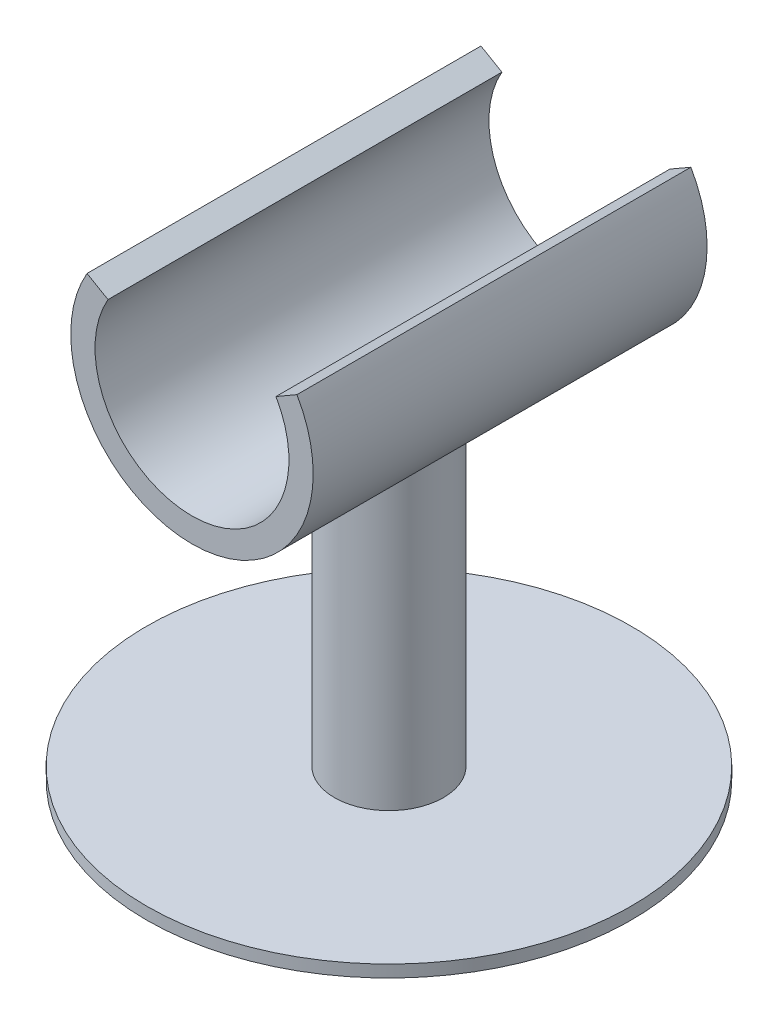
ISO-10303-21;
HEADER;
FILE_DESCRIPTION(('STEP AP214'),'2;1');
FILE_NAME('part.step','',(''),(''),'','','');
FILE_SCHEMA(('AUTOMOTIVE_DESIGN { 1 0 10303 214 1 1 1 1 }'));
ENDSEC;
DATA;
#1=APPLICATION_CONTEXT('core data for automotive mechanical design processes');
#2=APPLICATION_PROTOCOL_DEFINITION('international standard','automotive_design',2000,#1);
#3=PRODUCT_CONTEXT('',#1,'mechanical');
#4=PRODUCT('Part','Part','',(#3));
#5=PRODUCT_RELATED_PRODUCT_CATEGORY('part','',(#4));
#6=PRODUCT_DEFINITION_FORMATION('','',#4);
#7=PRODUCT_DEFINITION_CONTEXT('part definition',#1,'design');
#8=PRODUCT_DEFINITION('design','',#6,#7);
#9=PRODUCT_DEFINITION_SHAPE('','',#8);
#10=(LENGTH_UNIT() NAMED_UNIT(*) SI_UNIT(.MILLI.,.METRE.));
#11=(NAMED_UNIT(*) PLANE_ANGLE_UNIT() SI_UNIT($,.RADIAN.));
#12=(NAMED_UNIT(*) SI_UNIT($,.STERADIAN.) SOLID_ANGLE_UNIT());
#13=UNCERTAINTY_MEASURE_WITH_UNIT(LENGTH_MEASURE(1.E-05),#10,'distance_accuracy_value','');
#14=(GEOMETRIC_REPRESENTATION_CONTEXT(3) GLOBAL_UNCERTAINTY_ASSIGNED_CONTEXT((#13)) GLOBAL_UNIT_ASSIGNED_CONTEXT((#10,
#11,#12)) REPRESENTATION_CONTEXT('',''));
#15=CARTESIAN_POINT('',(0.,0.,0.));
#16=DIRECTION('',(0.,0.,1.));
#17=DIRECTION('',(1.,0.,0.));
#18=AXIS2_PLACEMENT_3D('',#15,#16,#17);
#19=CARTESIAN_POINT('',(0.,-68.,0.));
#20=DIRECTION('',(0.,1.,0.));
#21=DIRECTION('',(0.,0.,1.));
#22=AXIS2_PLACEMENT_3D('',#19,#20,#21);
#23=PLANE('',#22);
#24=CARTESIAN_POINT('',(0.,-68.,0.));
#25=DIRECTION('',(0.,1.,0.));
#26=DIRECTION('',(0.,0.,1.));
#27=AXIS2_PLACEMENT_3D('',#24,#25,#26);
#28=CIRCLE('',#27,40.);
#29=CARTESIAN_POINT('',(0.,-68.,40.));
#30=VERTEX_POINT('',#29);
#31=EDGE_CURVE('E11',#30,#30,#28,.T.);
#32=ORIENTED_EDGE('',*,*,#31,.T.);
#33=EDGE_LOOP('',(#32));
#34=FACE_BOUND('',#33,.T.);
#35=CARTESIAN_POINT('',(0.,-68.,0.));
#36=DIRECTION('',(0.,1.,0.));
#37=DIRECTION('',(0.,0.,1.));
#38=AXIS2_PLACEMENT_3D('',#35,#36,#37);
#39=CIRCLE('',#38,9.);
#40=CARTESIAN_POINT('',(0.,-68.,9.));
#41=VERTEX_POINT('',#40);
#42=EDGE_CURVE('E109',#41,#41,#39,.T.);
#43=ORIENTED_EDGE('',*,*,#42,.F.);
#44=EDGE_LOOP('',(#43));
#45=FACE_BOUND('',#44,.T.);
#46=ADVANCED_FACE('F32',(#34,#45),#23,.T.);
#47=CARTESIAN_POINT('',(0.,-68.,0.));
#48=DIRECTION('',(0.,-1.,0.));
#49=DIRECTION('',(0.,0.,-1.));
#50=AXIS2_PLACEMENT_3D('',#47,#48,#49);
#51=CYLINDRICAL_SURFACE('',#50,40.);
#52=ORIENTED_EDGE('',*,*,#31,.F.);
#53=EDGE_LOOP('',(#52));
#54=FACE_BOUND('',#53,.T.);
#55=CARTESIAN_POINT('',(0.,-70.,0.));
#56=DIRECTION('',(0.,1.,0.));
#57=DIRECTION('',(0.,0.,1.));
#58=AXIS2_PLACEMENT_3D('',#55,#56,#57);
#59=CIRCLE('',#58,40.);
#60=CARTESIAN_POINT('',(0.,-70.,40.));
#61=VERTEX_POINT('',#60);
#62=EDGE_CURVE('E36',#61,#61,#59,.T.);
#63=ORIENTED_EDGE('',*,*,#62,.T.);
#64=EDGE_LOOP('',(#63));
#65=FACE_BOUND('',#64,.T.);
#66=ADVANCED_FACE('F34',(#54,#65),#51,.T.);
#67=CARTESIAN_POINT('',(0.,-70.,0.));
#68=DIRECTION('',(0.,1.,0.));
#69=DIRECTION('',(0.,0.,1.));
#70=AXIS2_PLACEMENT_3D('',#67,#68,#69);
#71=PLANE('',#70);
#72=ORIENTED_EDGE('',*,*,#62,.F.);
#73=EDGE_LOOP('',(#72));
#74=FACE_BOUND('',#73,.T.);
#75=ADVANCED_FACE('F148',(#74),#71,.F.);
#76=CARTESIAN_POINT('',(0.,10.0010000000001,0.));
#77=DIRECTION('',(0.,-1.,0.));
#78=DIRECTION('',(0.,0.,-1.));
#79=AXIS2_PLACEMENT_3D('',#76,#77,#78);
#80=CYLINDRICAL_SURFACE('',#79,9.);
#81=ORIENTED_EDGE('',*,*,#42,.T.);
#82=EDGE_LOOP('',(#81));
#83=FACE_BOUND('',#82,.T.);
#84=CARTESIAN_POINT('',(0.,-20.,-9.));
#85=CARTESIAN_POINT('',(-0.239429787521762,-19.9999985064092,-8.99999822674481));
#86=CARTESIAN_POINT('',(-0.478916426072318,-19.9956892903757,-8.99043321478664));
#87=CARTESIAN_POINT('',(-0.956162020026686,-19.9785592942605,-8.95226864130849));
#88=CARTESIAN_POINT('',(-1.19391993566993,-19.965733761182,-8.92365845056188));
#89=CARTESIAN_POINT('',(-1.66631126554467,-19.9318736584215,-8.84764081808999));
#90=CARTESIAN_POINT('',(-1.90093746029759,-19.9108226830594,-8.80019580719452));
#91=CARTESIAN_POINT('',(-2.36491141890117,-19.8610585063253,-8.68701475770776));
#92=CARTESIAN_POINT('',(-2.5942588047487,-19.8323447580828,-8.62127741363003));
#93=CARTESIAN_POINT('',(-3.04529734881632,-19.7681022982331,-8.47244678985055));
#94=CARTESIAN_POINT('',(-3.26701374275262,-19.7325992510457,-8.38941876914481));
#95=CARTESIAN_POINT('',(-3.70234023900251,-19.6555728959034,-8.20660801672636));
#96=CARTESIAN_POINT('',(-3.91595009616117,-19.6140494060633,-8.10682477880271));
#97=CARTESIAN_POINT('',(-4.33377259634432,-19.5259822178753,-7.89136497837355));
#98=CARTESIAN_POINT('',(-4.53798969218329,-19.4794409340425,-7.77569605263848));
#99=CARTESIAN_POINT('',(-4.93616834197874,-19.3823697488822,-7.52921588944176));
#100=CARTESIAN_POINT('',(-5.13012612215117,-19.3318383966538,-7.39839913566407));
#101=CARTESIAN_POINT('',(-5.51651224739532,-19.2252516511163,-7.11536110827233));
#102=CARTESIAN_POINT('',(-5.70834540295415,-19.1690457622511,-6.9623837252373));
#103=CARTESIAN_POINT('',(-6.07860491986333,-19.0548708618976,-6.64157900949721));
#104=CARTESIAN_POINT('',(-6.25703067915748,-18.9969017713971,-6.47375101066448));
#105=CARTESIAN_POINT('',(-6.59969716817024,-18.880592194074,-6.12404836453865));
#106=CARTESIAN_POINT('',(-6.76392725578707,-18.8222514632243,-5.94216336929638));
#107=CARTESIAN_POINT('',(-7.07712505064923,-18.7067409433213,-5.56545458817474));
#108=CARTESIAN_POINT('',(-7.2260976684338,-18.6495707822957,-5.37063499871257));
#109=CARTESIAN_POINT('',(-7.516447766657,-18.5345311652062,-4.95688022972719));
#110=CARTESIAN_POINT('',(-7.65683040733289,-18.4768262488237,-4.73719938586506));
#111=CARTESIAN_POINT('',(-7.9184082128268,-18.3662455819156,-4.28565725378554));
#112=CARTESIAN_POINT('',(-8.03961140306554,-18.3133678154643,-4.05380111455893));
#113=CARTESIAN_POINT('',(-8.26179801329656,-18.2142115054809,-3.57928810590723));
#114=CARTESIAN_POINT('',(-8.36278610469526,-18.1679314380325,-3.33663374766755));
#115=CARTESIAN_POINT('',(-8.54350708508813,-18.0836512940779,-2.84214044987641));
#116=CARTESIAN_POINT('',(-8.62324185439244,-18.0456504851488,-2.59030232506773));
#117=CARTESIAN_POINT('',(-8.7568223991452,-17.9811920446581,-2.09302617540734));
#118=CARTESIAN_POINT('',(-8.81182321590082,-17.9542263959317,-1.84796444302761));
#119=CARTESIAN_POINT('',(-8.90123170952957,-17.9100690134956,-1.35323614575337));
#120=CARTESIAN_POINT('',(-8.93564011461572,-17.8928769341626,-1.10356974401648));
#121=CARTESIAN_POINT('',(-8.983384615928,-17.8689540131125,-0.601878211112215));
#122=CARTESIAN_POINT('',(-8.99673325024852,-17.862216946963,-0.349854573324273));
#123=CARTESIAN_POINT('',(-9.00220633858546,-17.8594595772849,0.15447371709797));
#124=CARTESIAN_POINT('',(-8.99433221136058,-17.8634385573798,0.406778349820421));
#125=CARTESIAN_POINT('',(-8.95918756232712,-17.8810873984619,0.886151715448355));
#126=CARTESIAN_POINT('',(-8.93378003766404,-17.8938260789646,1.11339448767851));
#127=CARTESIAN_POINT('',(-8.86586762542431,-17.927571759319,1.56476590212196));
#128=CARTESIAN_POINT('',(-8.82335693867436,-17.9485815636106,1.78889346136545));
#129=CARTESIAN_POINT('',(-8.72169967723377,-17.9981983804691,2.23242328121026));
#130=CARTESIAN_POINT('',(-8.66255655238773,-18.0268038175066,2.4518265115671));
#131=CARTESIAN_POINT('',(-8.52817531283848,-18.0907644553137,2.88472086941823));
#132=CARTESIAN_POINT('',(-8.45293084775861,-18.1261223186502,3.09820962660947));
#133=CARTESIAN_POINT('',(-8.28516411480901,-18.2034273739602,3.52268171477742));
#134=CARTESIAN_POINT('',(-8.19229591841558,-18.245503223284,3.73350468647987));
#135=CARTESIAN_POINT('',(-7.99111131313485,-18.3345094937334,4.14668124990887));
#136=CARTESIAN_POINT('',(-7.88278828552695,-18.3814419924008,4.34903116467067));
#137=CARTESIAN_POINT('',(-7.65143878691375,-18.4789403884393,4.74425148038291));
#138=CARTESIAN_POINT('',(-7.52841056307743,-18.529506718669,4.9371207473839));
#139=CARTESIAN_POINT('',(-7.26837600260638,-18.6330430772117,5.31251862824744));
#140=CARTESIAN_POINT('',(-7.13136875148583,-18.6860132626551,5.49504656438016));
#141=CARTESIAN_POINT('',(-6.82965137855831,-18.7985189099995,5.8667508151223));
#142=CARTESIAN_POINT('',(-6.66354094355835,-18.8581795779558,6.05475471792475));
#143=CARTESIAN_POINT('',(-6.31624490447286,-18.9773217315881,6.41621795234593));
#144=CARTESIAN_POINT('',(-6.13506386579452,-19.0368032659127,6.58968165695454));
#145=CARTESIAN_POINT('',(-5.75840783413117,-19.1541031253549,6.92125209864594));
#146=CARTESIAN_POINT('',(-5.56292293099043,-19.2119202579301,7.0793480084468));
#147=CARTESIAN_POINT('',(-5.15888778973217,-19.3243324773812,7.37896361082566));
#148=CARTESIAN_POINT('',(-4.95034282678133,-19.3789288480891,7.52048993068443));
#149=CARTESIAN_POINT('',(-4.51453513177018,-19.4851436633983,7.79016476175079));
#150=CARTESIAN_POINT('',(-4.28689080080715,-19.5366153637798,7.9177557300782));
#151=CARTESIAN_POINT('',(-3.82027307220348,-19.6331930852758,8.15314635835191));
#152=CARTESIAN_POINT('',(-3.58129930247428,-19.6782988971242,8.26094536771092));
#153=CARTESIAN_POINT('',(-3.09381683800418,-19.7608038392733,8.45559807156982));
#154=CARTESIAN_POINT('',(-2.84531318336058,-19.7982069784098,8.5424626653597));
#155=CARTESIAN_POINT('',(-2.34057316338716,-19.8642006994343,8.69431727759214));
#156=CARTESIAN_POINT('',(-2.08433750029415,-19.8927920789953,8.75930927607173));
#157=CARTESIAN_POINT('',(-1.58475659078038,-19.9385785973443,8.86278205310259));
#158=CARTESIAN_POINT('',(-1.3417946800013,-19.9564408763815,8.90282253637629));
#159=CARTESIAN_POINT('',(-0.852923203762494,-19.9833039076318,8.96287681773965));
#160=CARTESIAN_POINT('',(-0.607013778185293,-19.9923050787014,8.98289156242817));
#161=CARTESIAN_POINT('',(-0.114292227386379,-20.0011908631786,9.00265034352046));
#162=CARTESIAN_POINT('',(0.132519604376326,-20.0010782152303,9.00240046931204));
#163=CARTESIAN_POINT('',(0.625112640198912,-19.9917460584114,8.9816478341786));
#164=CARTESIAN_POINT('',(0.870893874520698,-19.9825268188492,8.96114567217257));
#165=CARTESIAN_POINT('',(1.34474026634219,-19.956065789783,8.90197788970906));
#166=CARTESIAN_POINT('',(1.57298140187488,-19.9393402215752,8.86447967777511));
#167=CARTESIAN_POINT('',(2.02534431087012,-19.8984816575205,8.77218815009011));
#168=CARTESIAN_POINT('',(2.24946463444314,-19.8743461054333,8.71738886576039));
#169=CARTESIAN_POINT('',(2.69199160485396,-19.8192555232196,8.59104867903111));
#170=CARTESIAN_POINT('',(2.910399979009,-19.7883025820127,8.51951290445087));
#171=CARTESIAN_POINT('',(3.34035601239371,-19.7202793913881,8.36029898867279));
#172=CARTESIAN_POINT('',(3.55190097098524,-19.683206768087,8.27261458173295));
#173=CARTESIAN_POINT('',(3.97325271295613,-19.6025680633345,8.07890250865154));
#174=CARTESIAN_POINT('',(4.18280716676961,-19.5588376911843,7.97239470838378));
#175=CARTESIAN_POINT('',(4.59227389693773,-19.4667686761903,7.74377379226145));
#176=CARTESIAN_POINT('',(4.79218192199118,-19.4184280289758,7.62165388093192));
#177=CARTESIAN_POINT('',(5.1813047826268,-19.3182414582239,7.36265667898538));
#178=CARTESIAN_POINT('',(5.37051814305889,-19.2663950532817,7.22577736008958));
#179=CARTESIAN_POINT('',(5.73735089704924,-19.1603566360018,6.93809376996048));
#180=CARTESIAN_POINT('',(5.9149696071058,-19.1061644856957,6.78728867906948));
#181=CARTESIAN_POINT('',(6.27198115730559,-18.9921091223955,6.45954492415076));
#182=CARTESIAN_POINT('',(6.45030692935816,-18.932147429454,6.28147645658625));
#183=CARTESIAN_POINT('',(6.79139001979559,-18.8124874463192,5.91104017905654));
#184=CARTESIAN_POINT('',(6.95415222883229,-18.7527890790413,5.71867689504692));
#185=CARTESIAN_POINT('',(7.26330947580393,-18.6352274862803,5.32051613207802));
#186=CARTESIAN_POINT('',(7.40969604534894,-18.5773652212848,5.11471178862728));
#187=CARTESIAN_POINT('',(7.68506041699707,-18.4651553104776,4.69081355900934));
#188=CARTESIAN_POINT('',(7.81403605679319,-18.4108081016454,4.47271815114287));
#189=CARTESIAN_POINT('',(8.05668444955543,-18.3059488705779,4.01964744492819));
#190=CARTESIAN_POINT('',(8.16987395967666,-18.2555727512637,3.78438116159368));
#191=CARTESIAN_POINT('',(8.37575861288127,-18.1620334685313,3.30378099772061));
#192=CARTESIAN_POINT('',(8.46846340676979,-18.1188669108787,3.05845192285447));
#193=CARTESIAN_POINT('',(8.63237146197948,-18.0413522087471,2.55950560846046));
#194=CARTESIAN_POINT('',(8.7035874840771,-18.0069988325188,2.30589338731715));
#195=CARTESIAN_POINT('',(8.82367465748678,-17.9484608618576,1.79228691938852));
#196=CARTESIAN_POINT('',(8.87254842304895,-17.9242750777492,1.53229342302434));
#197=CARTESIAN_POINT('',(8.94404152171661,-17.8886993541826,1.03083770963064));
#198=CARTESIAN_POINT('',(8.96856120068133,-17.8763859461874,0.789710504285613));
#199=CARTESIAN_POINT('',(8.9980603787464,-17.8615562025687,0.305966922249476));
#200=CARTESIAN_POINT('',(9.00304105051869,-17.85903927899,0.0633506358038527));
#201=CARTESIAN_POINT('',(8.99339869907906,-17.8638967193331,-0.421339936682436));
#202=CARTESIAN_POINT('',(8.97877958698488,-17.871269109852,-0.663414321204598));
#203=CARTESIAN_POINT('',(8.93013553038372,-17.8956256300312,-1.1451097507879));
#204=CARTESIAN_POINT('',(8.89611092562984,-17.9126095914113,-1.38473083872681));
#205=CARTESIAN_POINT('',(8.81184885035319,-17.9542019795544,-1.84457158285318));
#206=CARTESIAN_POINT('',(8.76277836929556,-17.9782576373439,-2.06505686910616));
#207=CARTESIAN_POINT('',(8.64847033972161,-18.0335240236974,-2.50094996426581));
#208=CARTESIAN_POINT('',(8.58322729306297,-18.0647371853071,-2.71635601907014));
#209=CARTESIAN_POINT('',(8.43717617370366,-18.1334100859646,-3.14076493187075));
#210=CARTESIAN_POINT('',(8.35637030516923,-18.1708689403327,-3.34976869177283));
#211=CARTESIAN_POINT('',(8.17983194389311,-18.2510202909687,-3.76036599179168));
#212=CARTESIAN_POINT('',(8.08409398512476,-18.2937147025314,-3.96195678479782));
#213=CARTESIAN_POINT('',(7.76222657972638,-18.4337980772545,-4.5795271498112));
#214=CARTESIAN_POINT('',(7.51078499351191,-18.5385811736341,-4.98096554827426));
#215=CARTESIAN_POINT('',(6.94944527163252,-18.7562139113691,-5.73825741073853));
#216=CARTESIAN_POINT('',(6.63952195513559,-18.8690670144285,-6.09409112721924));
#217=CARTESIAN_POINT('',(6.12049570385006,-19.0414534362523,-6.60344800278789));
#218=CARTESIAN_POINT('',(5.92952447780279,-19.1019265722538,-6.77546107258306));
#219=CARTESIAN_POINT('',(5.53314695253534,-19.2204841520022,-7.10283722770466));
#220=CARTESIAN_POINT('',(5.32774520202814,-19.2785693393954,-7.25820552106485));
#221=CARTESIAN_POINT('',(4.90349025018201,-19.3908219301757,-7.55131240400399));
#222=CARTESIAN_POINT('',(4.68462744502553,-19.4449864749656,-7.68903818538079));
#223=CARTESIAN_POINT('',(4.23488494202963,-19.5478628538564,-7.9456123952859));
#224=CARTESIAN_POINT('',(4.00400615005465,-19.5965750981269,-8.06446224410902));
#225=CARTESIAN_POINT('',(3.53403247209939,-19.6867289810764,-8.2811175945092));
#226=CARTESIAN_POINT('',(3.29504039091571,-19.728237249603,-8.37911808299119));
#227=CARTESIAN_POINT('',(2.80841945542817,-19.8033675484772,-8.55451052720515));
#228=CARTESIAN_POINT('',(2.5607915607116,-19.8369904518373,-8.63190476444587));
#229=CARTESIAN_POINT('',(2.0594421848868,-19.895281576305,-8.76503291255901));
#230=CARTESIAN_POINT('',(1.80573806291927,-19.9199726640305,-8.8208221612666));
#231=CARTESIAN_POINT('',(1.29384700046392,-19.9597536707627,-8.91029659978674));
#232=CARTESIAN_POINT('',(1.03566326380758,-19.9748501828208,-8.94399696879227));
#233=CARTESIAN_POINT('',(0.647365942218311,-19.9899382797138,-8.97762287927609));
#234=CARTESIAN_POINT('',(0.518072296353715,-19.9937081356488,-8.98601072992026));
#235=CARTESIAN_POINT('',(0.259191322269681,-19.9987394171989,-8.99719980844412));
#236=CARTESIAN_POINT('',(0.129603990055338,-20.0000008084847,-9.00000095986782));
#237=CARTESIAN_POINT('',(0.,-20.,-9.));
#238=B_SPLINE_CURVE_WITH_KNOTS('',3,(#84,#85,#86,#87,#88,#89,#90,#91,#92,#93,#94,#95,#96,#97,
#98,#99,#100,#101,#102,#103,#104,#105,#106,#107,#108,#109,#110,#111,#112,#113,#114,#115,#116,
#117,#118,#119,#120,#121,#122,#123,#124,#125,#126,#127,#128,#129,#130,#131,#132,#133,#134,#135,
#136,#137,#138,#139,#140,#141,#142,#143,#144,#145,#146,#147,#148,#149,#150,#151,#152,#153,#154,
#155,#156,#157,#158,#159,#160,#161,#162,#163,#164,#165,#166,#167,#168,#169,#170,#171,#172,#173,
#174,#175,#176,#177,#178,#179,#180,#181,#182,#183,#184,#185,#186,#187,#188,#189,#190,#191,#192,
#193,#194,#195,#196,#197,#198,#199,#200,#201,#202,#203,#204,#205,#206,#207,#208,#209,#210,#211,
#212,#213,#214,#215,#216,#217,#218,#219,#220,#221,#222,#223,#224,#225,#226,#227,#228,#229,#230,
#231,#232,#233,#234,#235,#236,#237),.UNSPECIFIED.,.T.,.F.,(4,2,2,2,2,2,2,2,2,2,2,2,2,2,2,2,2,2,
2,2,2,2,2,2,2,2,2,2,2,2,2,2,2,2,2,2,2,2,2,2,2,2,2,2,2,2,2,2,2,2,2,2,2,2,2,2,2,2,2,2,2,2,2,2,2,2,
2,2,2,2,2,2,2,2,2,2,4),(0.,0.718159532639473,1.43672021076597,2.15672143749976,2.87677406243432,
3.59415675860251,4.31156113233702,5.02862182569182,5.74594447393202,6.50027585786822,
7.25464109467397,8.00956704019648,8.76424924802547,9.56429618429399,10.364007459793,
11.1635337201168,11.9629892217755,12.7197566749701,13.4764973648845,14.2327873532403,
14.9890267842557,15.6752612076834,16.3617285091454,17.0480535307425,17.7346497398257,
18.4364610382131,19.1385738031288,19.8407703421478,20.5430128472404,21.3157604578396,
22.0882748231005,22.861329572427,23.634074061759,24.4310112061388,25.2279745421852,
26.0245220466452,26.820997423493,27.5606908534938,28.3003493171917,29.0397855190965,
29.7791998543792,30.4741133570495,31.1692668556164,31.8642076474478,32.5594186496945,
33.2759532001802,33.9928007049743,34.7097468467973,35.426735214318,36.2029926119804,
36.9790052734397,37.7554173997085,38.53192586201,39.3285593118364,40.1248166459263,
40.9206002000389,41.716290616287,42.4433761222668,43.1704179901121,43.8973147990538,
44.6241988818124,45.3049160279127,45.9858649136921,46.6667174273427,47.347819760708,
48.7968393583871,50.2464842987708,51.0377977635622,51.8288629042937,52.6204991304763,
53.4120757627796,54.1958878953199,54.9796132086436,55.7613176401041,56.5424843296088,
56.931220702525,57.3199623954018),.UNSPECIFIED.);
#239=CARTESIAN_POINT('',(0.,-20.,-9.));
#240=VERTEX_POINT('',#239);
#241=EDGE_CURVE('E112',#240,#240,#238,.T.);
#242=ORIENTED_EDGE('',*,*,#241,.F.);
#243=EDGE_LOOP('',(#242));
#244=FACE_BOUND('',#243,.T.);
#245=ADVANCED_FACE('F118',(#83,#244),#80,.T.);
#246=CARTESIAN_POINT('',(0.,0.,32.5));
#247=DIRECTION('',(0.,0.,-1.));
#248=DIRECTION('',(-1.,0.,0.));
#249=AXIS2_PLACEMENT_3D('',#246,#247,#248);
#250=CYLINDRICAL_SURFACE('',#249,20.);
#251=CARTESIAN_POINT('',(0.,0.,-32.5));
#252=DIRECTION('',(0.,0.,1.));
#253=DIRECTION('',(1.,0.,0.));
#254=AXIS2_PLACEMENT_3D('',#251,#252,#253);
#255=CIRCLE('',#254,20.);
#256=CARTESIAN_POINT('',(-17.3205080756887,10.0000000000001,-32.5));
#257=VERTEX_POINT('',#256);
#258=CARTESIAN_POINT('',(17.3205080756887,10.0000000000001,-32.5));
#259=VERTEX_POINT('',#258);
#260=EDGE_CURVE('E60',#257,#259,#255,.T.);
#261=ORIENTED_EDGE('',*,*,#260,.T.);
#262=DIRECTION('',(0.,0.,-1.));
#263=VECTOR('',#262,1.);
#264=CARTESIAN_POINT('',(17.3205080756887,10.0000000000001,32.5));
#265=LINE('',#264,#263);
#266=CARTESIAN_POINT('',(17.3205080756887,10.0000000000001,32.5));
#267=VERTEX_POINT('',#266);
#268=EDGE_CURVE('E107',#267,#259,#265,.T.);
#269=ORIENTED_EDGE('',*,*,#268,.F.);
#270=CARTESIAN_POINT('',(0.,0.,32.5));
#271=DIRECTION('',(0.,0.,1.));
#272=DIRECTION('',(1.,0.,0.));
#273=AXIS2_PLACEMENT_3D('',#270,#271,#272);
#274=CIRCLE('',#273,20.);
#275=CARTESIAN_POINT('',(-17.3205080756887,10.0000000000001,32.5));
#276=VERTEX_POINT('',#275);
#277=EDGE_CURVE('E65',#276,#267,#274,.T.);
#278=ORIENTED_EDGE('',*,*,#277,.F.);
#279=DIRECTION('',(0.,0.,-1.));
#280=VECTOR('',#279,1.);
#281=CARTESIAN_POINT('',(-17.3205080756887,10.0000000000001,32.5));
#282=LINE('',#281,#280);
#283=EDGE_CURVE('E89',#276,#257,#282,.T.);
#284=ORIENTED_EDGE('',*,*,#283,.T.);
#285=EDGE_LOOP('',(#261,#269,#278,#284));
#286=FACE_BOUND('',#285,.T.);
#287=ORIENTED_EDGE('',*,*,#241,.T.);
#288=EDGE_LOOP('',(#287));
#289=FACE_BOUND('',#288,.T.);
#290=ADVANCED_FACE('F126',(#286,#289),#250,.T.);
#291=CARTESIAN_POINT('',(0.,0.,32.5));
#292=DIRECTION('',(0.,0.,-1.));
#293=DIRECTION('',(-1.,0.,0.));
#294=AXIS2_PLACEMENT_3D('',#291,#292,#293);
#295=CYLINDRICAL_SURFACE('',#294,16.);
#296=CARTESIAN_POINT('',(0.,0.,-32.5));
#297=DIRECTION('',(0.,0.,-1.));
#298=DIRECTION('',(1.,0.,0.));
#299=AXIS2_PLACEMENT_3D('',#296,#297,#298);
#300=CIRCLE('',#299,16.);
#301=CARTESIAN_POINT('',(13.856406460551,8.00000000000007,-32.5));
#302=VERTEX_POINT('',#301);
#303=CARTESIAN_POINT('',(-13.856406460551,8.00000000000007,-32.5));
#304=VERTEX_POINT('',#303);
#305=EDGE_CURVE('E90',#302,#304,#300,.T.);
#306=ORIENTED_EDGE('',*,*,#305,.T.);
#307=DIRECTION('',(0.,0.,-1.));
#308=VECTOR('',#307,1.);
#309=CARTESIAN_POINT('',(-13.856406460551,8.00000000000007,32.5));
#310=LINE('',#309,#308);
#311=CARTESIAN_POINT('',(-13.856406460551,8.00000000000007,32.5));
#312=VERTEX_POINT('',#311);
#313=EDGE_CURVE('E88',#312,#304,#310,.T.);
#314=ORIENTED_EDGE('',*,*,#313,.F.);
#315=CARTESIAN_POINT('',(0.,0.,32.5));
#316=DIRECTION('',(0.,0.,-1.));
#317=DIRECTION('',(1.,0.,0.));
#318=AXIS2_PLACEMENT_3D('',#315,#316,#317);
#319=CIRCLE('',#318,16.);
#320=CARTESIAN_POINT('',(13.856406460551,8.00000000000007,32.5));
#321=VERTEX_POINT('',#320);
#322=EDGE_CURVE('E74',#321,#312,#319,.T.);
#323=ORIENTED_EDGE('',*,*,#322,.F.);
#324=DIRECTION('',(0.,0.,-1.));
#325=VECTOR('',#324,1.);
#326=CARTESIAN_POINT('',(13.856406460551,8.00000000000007,32.5));
#327=LINE('',#326,#325);
#328=EDGE_CURVE('E102',#321,#302,#327,.T.);
#329=ORIENTED_EDGE('',*,*,#328,.T.);
#330=EDGE_LOOP('',(#306,#314,#323,#329));
#331=FACE_BOUND('',#330,.T.);
#332=ADVANCED_FACE('F93',(#331),#295,.F.);
#333=CARTESIAN_POINT('',(13.856406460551,8.00000000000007,32.5));
#334=DIRECTION('',(0.500000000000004,-0.866025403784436,0.));
#335=DIRECTION('',(0.866025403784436,0.500000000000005,0.));
#336=AXIS2_PLACEMENT_3D('',#333,#334,#335);
#337=PLANE('',#336);
#338=DIRECTION('',(-0.866025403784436,-0.500000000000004,0.));
#339=VECTOR('',#338,1.);
#340=CARTESIAN_POINT('',(13.856406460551,8.00000000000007,-32.5));
#341=LINE('',#340,#339);
#342=EDGE_CURVE('E82',#259,#302,#341,.T.);
#343=ORIENTED_EDGE('',*,*,#342,.T.);
#344=ORIENTED_EDGE('',*,*,#328,.F.);
#345=DIRECTION('',(-0.866025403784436,-0.500000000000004,0.));
#346=VECTOR('',#345,1.);
#347=CARTESIAN_POINT('',(13.856406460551,8.00000000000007,32.5));
#348=LINE('',#347,#346);
#349=EDGE_CURVE('E49',#267,#321,#348,.T.);
#350=ORIENTED_EDGE('',*,*,#349,.F.);
#351=ORIENTED_EDGE('',*,*,#268,.T.);
#352=EDGE_LOOP('',(#343,#344,#350,#351));
#353=FACE_BOUND('',#352,.T.);
#354=ADVANCED_FACE('F125',(#353),#337,.F.);
#355=CARTESIAN_POINT('',(0.,0.,32.5));
#356=DIRECTION('',(0.,0.,1.));
#357=DIRECTION('',(1.,0.,0.));
#358=AXIS2_PLACEMENT_3D('',#355,#356,#357);
#359=PLANE('',#358);
#360=ORIENTED_EDGE('',*,*,#322,.T.);
#361=DIRECTION('',(0.866025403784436,-0.500000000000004,0.));
#362=VECTOR('',#361,1.);
#363=CARTESIAN_POINT('',(-13.856406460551,8.00000000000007,32.5));
#364=LINE('',#363,#362);
#365=EDGE_CURVE('E77',#276,#312,#364,.T.);
#366=ORIENTED_EDGE('',*,*,#365,.F.);
#367=ORIENTED_EDGE('',*,*,#277,.T.);
#368=ORIENTED_EDGE('',*,*,#349,.T.);
#369=EDGE_LOOP('',(#360,#366,#367,#368));
#370=FACE_BOUND('',#369,.T.);
#371=ADVANCED_FACE('F76',(#370),#359,.T.);
#372=CARTESIAN_POINT('',(0.,0.,-32.5));
#373=DIRECTION('',(0.,0.,1.));
#374=DIRECTION('',(1.,0.,0.));
#375=AXIS2_PLACEMENT_3D('',#372,#373,#374);
#376=PLANE('',#375);
#377=ORIENTED_EDGE('',*,*,#305,.F.);
#378=ORIENTED_EDGE('',*,*,#342,.F.);
#379=ORIENTED_EDGE('',*,*,#260,.F.);
#380=DIRECTION('',(0.866025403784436,-0.500000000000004,0.));
#381=VECTOR('',#380,1.);
#382=CARTESIAN_POINT('',(-13.856406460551,8.00000000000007,-32.5));
#383=LINE('',#382,#381);
#384=EDGE_CURVE('E91',#257,#304,#383,.T.);
#385=ORIENTED_EDGE('',*,*,#384,.T.);
#386=EDGE_LOOP('',(#377,#378,#379,#385));
#387=FACE_BOUND('',#386,.T.);
#388=ADVANCED_FACE('F132',(#387),#376,.F.);
#389=CARTESIAN_POINT('',(-13.856406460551,8.00000000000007,32.5));
#390=DIRECTION('',(-0.500000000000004,-0.866025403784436,0.));
#391=DIRECTION('',(-0.866025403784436,0.500000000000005,0.));
#392=AXIS2_PLACEMENT_3D('',#389,#390,#391);
#393=PLANE('',#392);
#394=ORIENTED_EDGE('',*,*,#384,.F.);
#395=ORIENTED_EDGE('',*,*,#283,.F.);
#396=ORIENTED_EDGE('',*,*,#365,.T.);
#397=ORIENTED_EDGE('',*,*,#313,.T.);
#398=EDGE_LOOP('',(#394,#395,#396,#397));
#399=FACE_BOUND('',#398,.T.);
#400=ADVANCED_FACE('F87',(#399),#393,.F.);
#401=CLOSED_SHELL('',(#46,#66,#75,#245,#290,#332,#354,#371,#388,#400));
#402=MANIFOLD_SOLID_BREP('B2',#401);
#403=ADVANCED_BREP_SHAPE_REPRESENTATION('',(#18,#402),#14);
#404=SHAPE_DEFINITION_REPRESENTATION(#9,#403);
ENDSEC;
END-ISO-10303-21;
